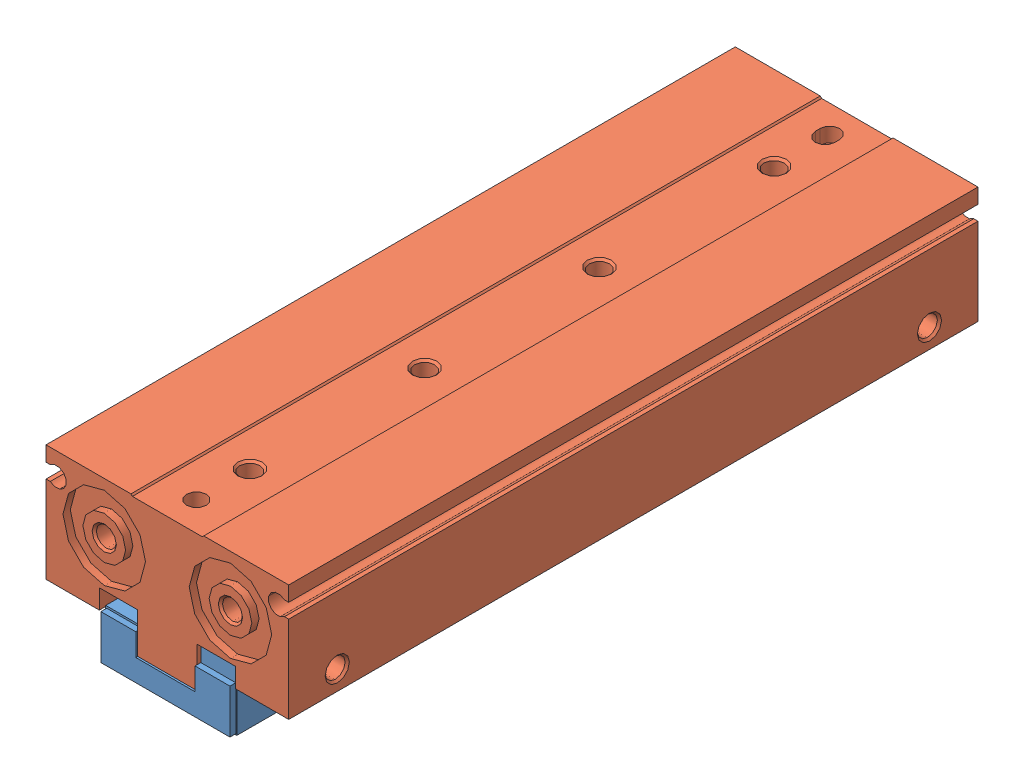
SolidWorks assembly SHF16-64D.sldasm, configuration Default (file format 11000). Lengths in mm.
Overall size (50 33 142.8).
3 component instances, 2 part files, 0 mates.
Components (placement in the parent):
- SHF16-6402-3: SHF16-6402.sldprt [Default] at (0 -33 -32) x (-1 0 0) z (0 0 -1) size (27 14.6 93.2)
- SHF16-6402-2: SHF16-6402.sldprt [Default] at (0 -33 32) size (27 14.6 93.2)
- SHF16-6401-1: SHF16-6401.sldprt [Default] at origin size (50 28.3 142)
